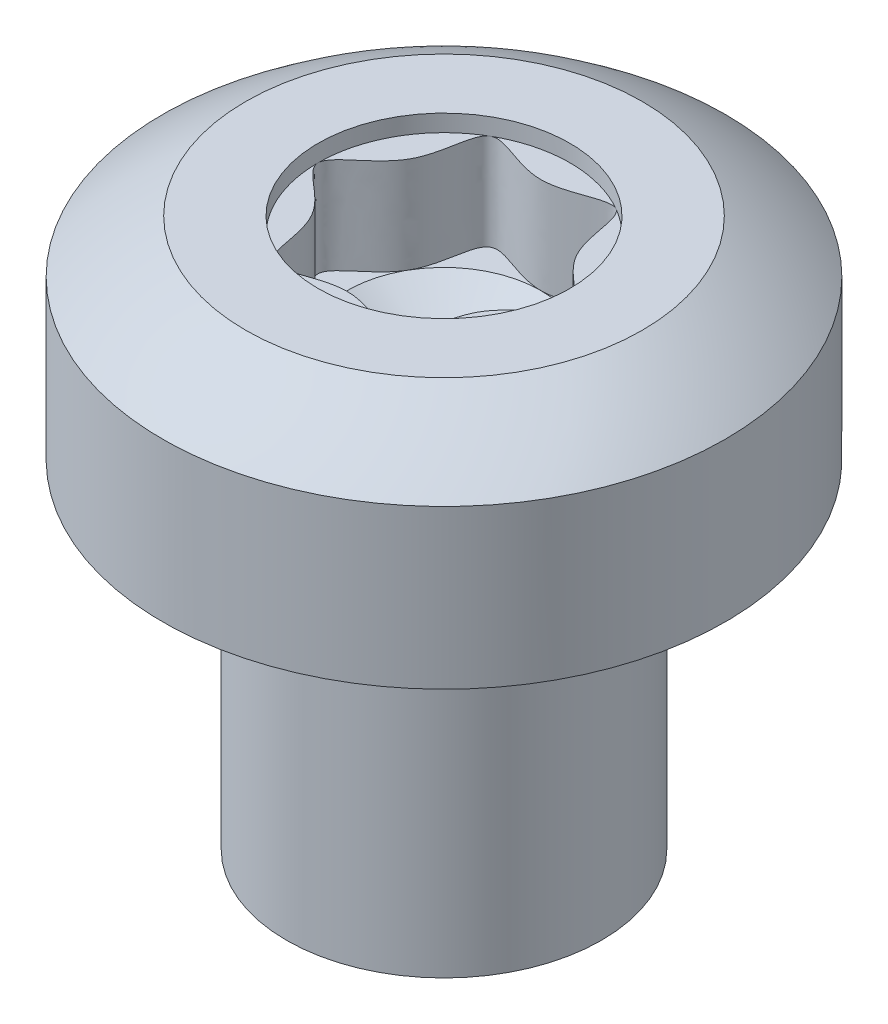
from build123d import *

# Parameters (mm, degrees)
RECESS_CUT_EXTRUDE1_DEPTH = 4.02
SKETCH7_R                 = 4.475
RECESS_CUT_EXTRUDE2_DEPTH = 0.603


with BuildPart() as part:
    # Sketch1 → BODY (revolve)
    with BuildSketch(Plane.XY, mode=Mode.PRIVATE) as body_sk:
        Polygon((0, 0), (5.6, 0), (5.6, 12), (10, 12), (10, 19.5), (0, 19.5), align=None)
    revolve(body_sk.sketch.rotate(Axis((0, 0, 0), (0, 1, 0)), 90), axis=Axis((0, 0, 0), (0, 1, 0)))

    # Sketch2 → HEAD-CUT (revolve, cut)
    with BuildSketch(Plane.XY, mode=Mode.PRIVATE) as head_cut_sk:
        with BuildLine():
            ThreePointArc((16, 5.135004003), (11.313708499, 16.448712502), (0, 21.135004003))
            Line((0, 21.135004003), (0, 21.617165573))
            Line((0, 21.617165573), (16, 21.617165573))
            Line((16, 21.617165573), (16, 5.135004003))
        make_face()
    revolve(head_cut_sk.sketch.rotate(Axis((0, 0, 0), (0, 1, 0)), 90), axis=Axis((0, 0, 0), (0, 1, 0)), mode=Mode.SUBTRACT)

    # Sketch4 → GAP (revolve, cut)
    with BuildSketch(Plane.XY, mode=Mode.PRIVATE) as gap_sk:
        with BuildLine():
            Line((-5.6, 9), (-5.366841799, 11.6))
            ThreePointArc((-5.366841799, 11.6), (-5.419665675, 11.837162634), (-5.6, 12))
            Line((-5.6, 12), (-5.6, 9))
        make_face()
    revolve(gap_sk.sketch.rotate(Axis((0, 0, 0), (0, 1, 0)), 270), axis=Axis((0, 0, 0), (0, 1, 0)), mode=Mode.SUBTRACT)

    # Sketch5 → Recess-Cut-Extrude1 (cut)
    with BuildSketch(Plane(origin=(0, 19.5, 0), x_dir=(-1, 0, 0), z_dir=(0, 1, 0))):
        with BuildLine():
            add(Edge.make_bspline(
                [(0, 3.442307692), (-0.918288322, 3.442307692), (-2.754864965, 4.771566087), (-2.40554014, 1.388839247), (-5.50972993, 0), (-2.40554014, -1.388839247), (-2.754864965, -4.771566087), (0, -2.777678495), (2.754864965, -4.771566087), (2.40554014, -1.388839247), (5.50972993, 0), (2.40554014, 1.388839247), (2.754864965, 4.771566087), (0.918288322, 3.442307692), (0, 3.442307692)],
                knots=[0, 0, 0, 0, 0.083333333, 0.166666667, 0.25, 0.333333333, 0.416666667, 0.5, 0.583333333, 0.666666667, 0.75, 0.833333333, 0.916666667, 1, 1, 1, 1], degree=3))
        make_face()
    extrude(amount=-RECESS_CUT_EXTRUDE1_DEPTH, mode=Mode.SUBTRACT)

    # Sketch3 → DRILL-CUT (revolve, cut)
    with BuildSketch(Plane.XY, mode=Mode.PRIVATE) as drill_cut_sk:
        Polygon((0, 13.492582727), (3.442307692, 15.48), (0, 15.48), align=None)
    revolve(drill_cut_sk.sketch.rotate(Axis((0, 0, 0), (0, 1, 0)), 270), axis=Axis((0, 0, 0), (0, 1, 0)), mode=Mode.SUBTRACT)

    # Sketch7 → Recess-Cut-Extrude2 (cut)
    with BuildSketch(Plane(origin=(0, 19.5, 0), x_dir=(-1, 0, 0), z_dir=(0, 1, 0))):
        with Locations(Location((0, 0, 0), (0, 0, 90))):
            Circle(SKETCH7_R)
    extrude(amount=-RECESS_CUT_EXTRUDE2_DEPTH, mode=Mode.SUBTRACT)


solid = part.part
